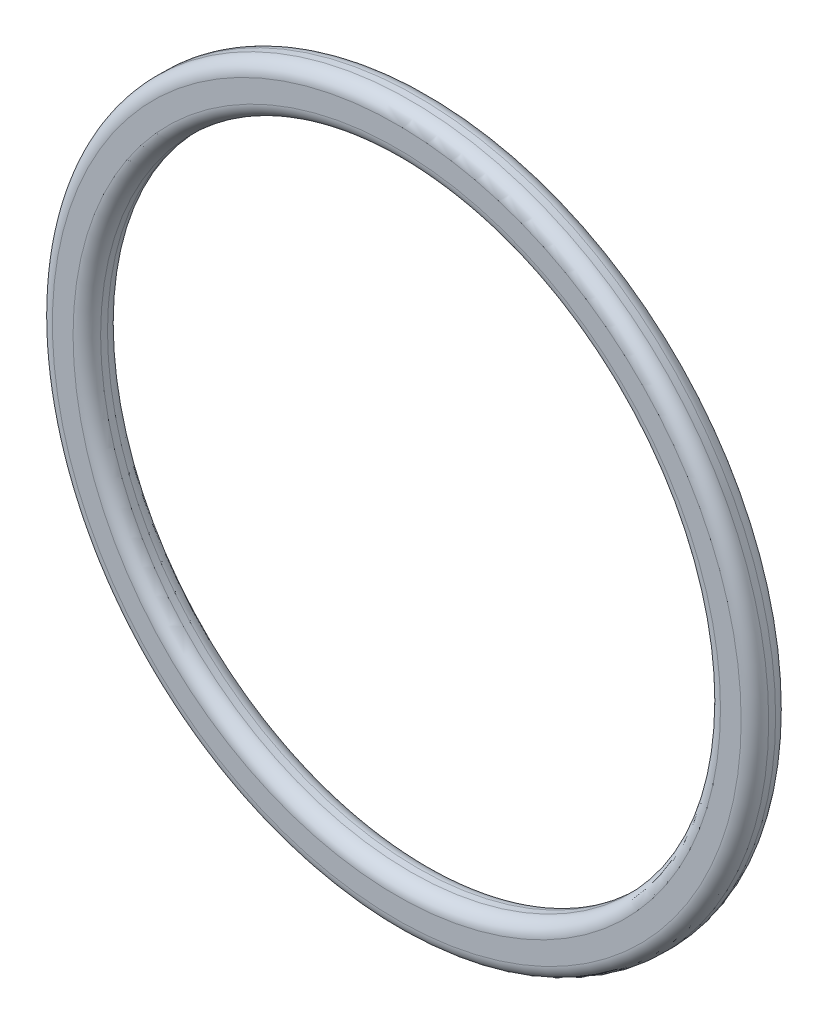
ISO-10303-21;
HEADER;
FILE_DESCRIPTION(('STEP AP214'),'2;1');
FILE_NAME('part.step','',(''),(''),'','','');
FILE_SCHEMA(('AUTOMOTIVE_DESIGN { 1 0 10303 214 1 1 1 1 }'));
ENDSEC;
DATA;
#1=APPLICATION_CONTEXT('core data for automotive mechanical design processes');
#2=APPLICATION_PROTOCOL_DEFINITION('international standard','automotive_design',2000,#1);
#3=PRODUCT_CONTEXT('',#1,'mechanical');
#4=PRODUCT('Part','Part','',(#3));
#5=PRODUCT_RELATED_PRODUCT_CATEGORY('part','',(#4));
#6=PRODUCT_DEFINITION_FORMATION('','',#4);
#7=PRODUCT_DEFINITION_CONTEXT('part definition',#1,'design');
#8=PRODUCT_DEFINITION('design','',#6,#7);
#9=PRODUCT_DEFINITION_SHAPE('','',#8);
#10=(LENGTH_UNIT() NAMED_UNIT(*) SI_UNIT(.MILLI.,.METRE.));
#11=(NAMED_UNIT(*) PLANE_ANGLE_UNIT() SI_UNIT($,.RADIAN.));
#12=(NAMED_UNIT(*) SI_UNIT($,.STERADIAN.) SOLID_ANGLE_UNIT());
#13=UNCERTAINTY_MEASURE_WITH_UNIT(LENGTH_MEASURE(1.E-05),#10,'distance_accuracy_value','');
#14=(GEOMETRIC_REPRESENTATION_CONTEXT(3) GLOBAL_UNCERTAINTY_ASSIGNED_CONTEXT((#13)) GLOBAL_UNIT_ASSIGNED_CONTEXT((#10,
#11,#12)) REPRESENTATION_CONTEXT('',''));
#15=CARTESIAN_POINT('',(0.,0.,0.));
#16=DIRECTION('',(0.,0.,1.));
#17=DIRECTION('',(1.,0.,0.));
#18=AXIS2_PLACEMENT_3D('',#15,#16,#17);
#19=CARTESIAN_POINT('',(0.,0.,-1.95936170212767));
#20=DIRECTION('',(0.,0.,1.));
#21=DIRECTION('',(1.,0.,0.));
#22=AXIS2_PLACEMENT_3D('',#19,#20,#21);
#23=TOROIDAL_SURFACE('',#22,23.5,1.);
#24=CARTESIAN_POINT('',(0.,0.,-2.95936170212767));
#25=DIRECTION('',(0.,0.,1.));
#26=DIRECTION('',(1.,0.,0.));
#27=AXIS2_PLACEMENT_3D('',#24,#25,#26);
#28=CIRCLE('',#27,23.5);
#29=CARTESIAN_POINT('',(23.5,0.,-2.95936170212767));
#30=VERTEX_POINT('',#29);
#31=EDGE_CURVE('E10',#30,#30,#28,.T.);
#32=ORIENTED_EDGE('',*,*,#31,.F.);
#33=EDGE_LOOP('',(#32));
#34=FACE_BOUND('',#33,.T.);
#35=CARTESIAN_POINT('',(0.,0.,-1.95936170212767));
#36=DIRECTION('',(0.,0.,1.));
#37=DIRECTION('',(1.,0.,0.));
#38=AXIS2_PLACEMENT_3D('',#35,#36,#37);
#39=CIRCLE('',#38,22.5);
#40=CARTESIAN_POINT('',(22.5,0.,-1.95936170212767));
#41=VERTEX_POINT('',#40);
#42=EDGE_CURVE('E56',#41,#41,#39,.T.);
#43=ORIENTED_EDGE('',*,*,#42,.T.);
#44=EDGE_LOOP('',(#43));
#45=FACE_BOUND('',#44,.T.);
#46=ADVANCED_FACE('F28',(#34,#45),#23,.T.);
#47=CARTESIAN_POINT('',(0.,25.,-2.95936170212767));
#48=DIRECTION('',(0.,0.,1.));
#49=DIRECTION('',(1.,0.,0.));
#50=AXIS2_PLACEMENT_3D('',#47,#48,#49);
#51=PLANE('',#50);
#52=CARTESIAN_POINT('',(0.,0.,-2.95936170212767));
#53=DIRECTION('',(0.,0.,1.));
#54=DIRECTION('',(1.,0.,0.));
#55=AXIS2_PLACEMENT_3D('',#52,#53,#54);
#56=CIRCLE('',#55,25.);
#57=CARTESIAN_POINT('',(25.,0.,-2.95936170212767));
#58=VERTEX_POINT('',#57);
#59=EDGE_CURVE('E34',#58,#58,#56,.T.);
#60=ORIENTED_EDGE('',*,*,#59,.F.);
#61=EDGE_LOOP('',(#60));
#62=FACE_BOUND('',#61,.T.);
#63=ORIENTED_EDGE('',*,*,#31,.T.);
#64=EDGE_LOOP('',(#63));
#65=FACE_BOUND('',#64,.T.);
#66=ADVANCED_FACE('F93',(#62,#65),#51,.F.);
#67=CARTESIAN_POINT('',(0.,0.,-1.95936170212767));
#68=DIRECTION('',(0.,0.,1.));
#69=DIRECTION('',(1.,0.,0.));
#70=AXIS2_PLACEMENT_3D('',#67,#68,#69);
#71=TOROIDAL_SURFACE('',#70,25.,1.);
#72=CARTESIAN_POINT('',(0.,0.,-1.95936170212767));
#73=DIRECTION('',(0.,0.,1.));
#74=DIRECTION('',(1.,0.,0.));
#75=AXIS2_PLACEMENT_3D('',#72,#73,#74);
#76=CIRCLE('',#75,26.);
#77=CARTESIAN_POINT('',(26.,0.,-1.95936170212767));
#78=VERTEX_POINT('',#77);
#79=EDGE_CURVE('E38',#78,#78,#76,.T.);
#80=ORIENTED_EDGE('',*,*,#79,.F.);
#81=EDGE_LOOP('',(#80));
#82=FACE_BOUND('',#81,.T.);
#83=ORIENTED_EDGE('',*,*,#59,.T.);
#84=EDGE_LOOP('',(#83));
#85=FACE_BOUND('',#84,.T.);
#86=ADVANCED_FACE('F88',(#82,#85),#71,.T.);
#87=CARTESIAN_POINT('',(0.,0.,20.8243971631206));
#88=DIRECTION('',(0.,0.,1.));
#89=DIRECTION('',(1.,0.,0.));
#90=AXIS2_PLACEMENT_3D('',#87,#88,#89);
#91=CYLINDRICAL_SURFACE('',#90,26.);
#92=CARTESIAN_POINT('',(0.,0.,-1.45936170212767));
#93=DIRECTION('',(0.,0.,1.));
#94=DIRECTION('',(1.,0.,0.));
#95=AXIS2_PLACEMENT_3D('',#92,#93,#94);
#96=CIRCLE('',#95,26.);
#97=CARTESIAN_POINT('',(26.,0.,-1.45936170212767));
#98=VERTEX_POINT('',#97);
#99=EDGE_CURVE('E42',#98,#98,#96,.T.);
#100=ORIENTED_EDGE('',*,*,#99,.F.);
#101=EDGE_LOOP('',(#100));
#102=FACE_BOUND('',#101,.T.);
#103=ORIENTED_EDGE('',*,*,#79,.T.);
#104=EDGE_LOOP('',(#103));
#105=FACE_BOUND('',#104,.T.);
#106=ADVANCED_FACE('F82',(#102,#105),#91,.T.);
#107=CARTESIAN_POINT('',(0.,0.,-1.45936170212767));
#108=DIRECTION('',(0.,0.,1.));
#109=DIRECTION('',(1.,0.,0.));
#110=AXIS2_PLACEMENT_3D('',#107,#108,#109);
#111=TOROIDAL_SURFACE('',#110,25.,1.);
#112=CARTESIAN_POINT('',(0.,0.,-0.459361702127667));
#113=DIRECTION('',(0.,0.,1.));
#114=DIRECTION('',(1.,0.,0.));
#115=AXIS2_PLACEMENT_3D('',#112,#113,#114);
#116=CIRCLE('',#115,25.);
#117=CARTESIAN_POINT('',(25.,0.,-0.459361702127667));
#118=VERTEX_POINT('',#117);
#119=EDGE_CURVE('E47',#118,#118,#116,.T.);
#120=ORIENTED_EDGE('',*,*,#119,.F.);
#121=EDGE_LOOP('',(#120));
#122=FACE_BOUND('',#121,.T.);
#123=ORIENTED_EDGE('',*,*,#99,.T.);
#124=EDGE_LOOP('',(#123));
#125=FACE_BOUND('',#124,.T.);
#126=ADVANCED_FACE('F76',(#122,#125),#111,.T.);
#127=CARTESIAN_POINT('',(0.,25.,-0.459361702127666));
#128=DIRECTION('',(0.,0.,-1.));
#129=DIRECTION('',(-1.,0.,0.));
#130=AXIS2_PLACEMENT_3D('',#127,#128,#129);
#131=PLANE('',#130);
#132=CARTESIAN_POINT('',(0.,0.,-0.459361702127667));
#133=DIRECTION('',(0.,0.,1.));
#134=DIRECTION('',(1.,0.,0.));
#135=AXIS2_PLACEMENT_3D('',#132,#133,#134);
#136=CIRCLE('',#135,23.5);
#137=CARTESIAN_POINT('',(23.5,0.,-0.459361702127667));
#138=VERTEX_POINT('',#137);
#139=EDGE_CURVE('E50',#138,#138,#136,.T.);
#140=ORIENTED_EDGE('',*,*,#139,.F.);
#141=EDGE_LOOP('',(#140));
#142=FACE_BOUND('',#141,.T.);
#143=ORIENTED_EDGE('',*,*,#119,.T.);
#144=EDGE_LOOP('',(#143));
#145=FACE_BOUND('',#144,.T.);
#146=ADVANCED_FACE('F70',(#142,#145),#131,.F.);
#147=CARTESIAN_POINT('',(0.,0.,-1.45936170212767));
#148=DIRECTION('',(0.,0.,1.));
#149=DIRECTION('',(1.,0.,0.));
#150=AXIS2_PLACEMENT_3D('',#147,#148,#149);
#151=TOROIDAL_SURFACE('',#150,23.5,1.);
#152=CARTESIAN_POINT('',(0.,0.,-1.45936170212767));
#153=DIRECTION('',(0.,0.,1.));
#154=DIRECTION('',(1.,0.,0.));
#155=AXIS2_PLACEMENT_3D('',#152,#153,#154);
#156=CIRCLE('',#155,22.5);
#157=CARTESIAN_POINT('',(22.5,0.,-1.45936170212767));
#158=VERTEX_POINT('',#157);
#159=EDGE_CURVE('E53',#158,#158,#156,.T.);
#160=ORIENTED_EDGE('',*,*,#159,.F.);
#161=EDGE_LOOP('',(#160));
#162=FACE_BOUND('',#161,.T.);
#163=ORIENTED_EDGE('',*,*,#139,.T.);
#164=EDGE_LOOP('',(#163));
#165=FACE_BOUND('',#164,.T.);
#166=ADVANCED_FACE('F64',(#162,#165),#151,.T.);
#167=CARTESIAN_POINT('',(0.,0.,20.8243971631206));
#168=DIRECTION('',(0.,0.,1.));
#169=DIRECTION('',(1.,0.,0.));
#170=AXIS2_PLACEMENT_3D('',#167,#168,#169);
#171=CYLINDRICAL_SURFACE('',#170,22.5);
#172=ORIENTED_EDGE('',*,*,#42,.F.);
#173=EDGE_LOOP('',(#172));
#174=FACE_BOUND('',#173,.T.);
#175=ORIENTED_EDGE('',*,*,#159,.T.);
#176=EDGE_LOOP('',(#175));
#177=FACE_BOUND('',#176,.T.);
#178=ADVANCED_FACE('F61',(#174,#177),#171,.F.);
#179=CLOSED_SHELL('',(#46,#66,#86,#106,#126,#146,#166,#178));
#180=MANIFOLD_SOLID_BREP('B2',#179);
#181=ADVANCED_BREP_SHAPE_REPRESENTATION('',(#18,#180),#14);
#182=SHAPE_DEFINITION_REPRESENTATION(#9,#181);
ENDSEC;
END-ISO-10303-21;
